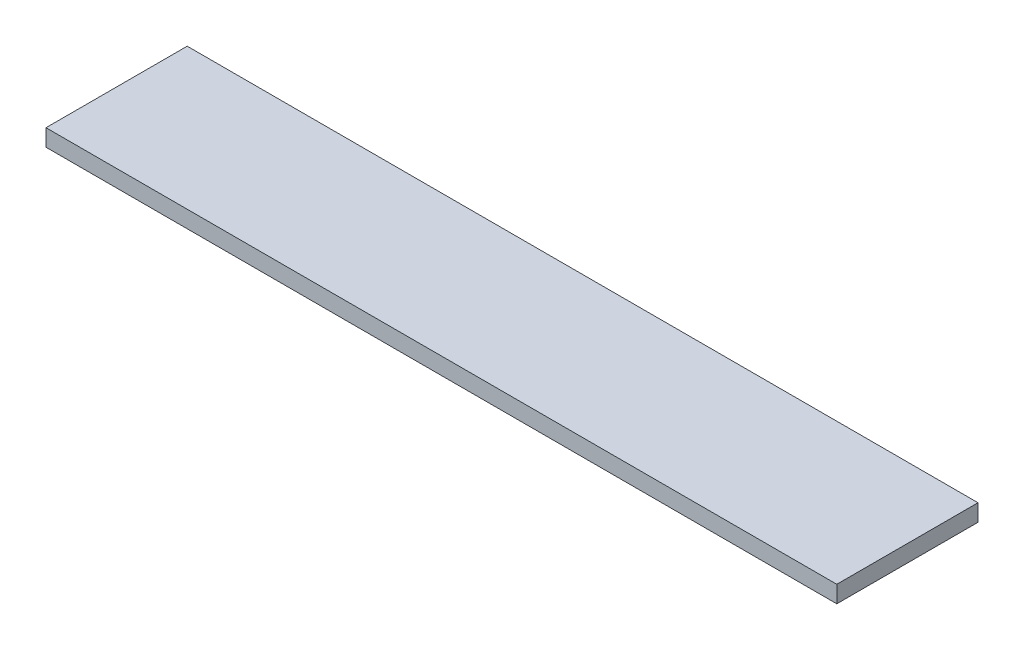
ISO-10303-21;
HEADER;
FILE_DESCRIPTION(('STEP AP214'),'2;1');
FILE_NAME('part.step','',(''),(''),'','','');
FILE_SCHEMA(('AUTOMOTIVE_DESIGN { 1 0 10303 214 1 1 1 1 }'));
ENDSEC;
DATA;
#1=APPLICATION_CONTEXT('core data for automotive mechanical design processes');
#2=APPLICATION_PROTOCOL_DEFINITION('international standard','automotive_design',2000,#1);
#3=PRODUCT_CONTEXT('',#1,'mechanical');
#4=PRODUCT('Part','Part','',(#3));
#5=PRODUCT_RELATED_PRODUCT_CATEGORY('part','',(#4));
#6=PRODUCT_DEFINITION_FORMATION('','',#4);
#7=PRODUCT_DEFINITION_CONTEXT('part definition',#1,'design');
#8=PRODUCT_DEFINITION('design','',#6,#7);
#9=PRODUCT_DEFINITION_SHAPE('','',#8);
#10=(LENGTH_UNIT() NAMED_UNIT(*) SI_UNIT(.MILLI.,.METRE.));
#11=(NAMED_UNIT(*) PLANE_ANGLE_UNIT() SI_UNIT($,.RADIAN.));
#12=(NAMED_UNIT(*) SI_UNIT($,.STERADIAN.) SOLID_ANGLE_UNIT());
#13=UNCERTAINTY_MEASURE_WITH_UNIT(LENGTH_MEASURE(1.E-05),#10,'distance_accuracy_value','');
#14=(GEOMETRIC_REPRESENTATION_CONTEXT(3) GLOBAL_UNCERTAINTY_ASSIGNED_CONTEXT((#13)) GLOBAL_UNIT_ASSIGNED_CONTEXT((#10,
#11,#12)) REPRESENTATION_CONTEXT('',''));
#15=CARTESIAN_POINT('',(0.,0.,0.));
#16=DIRECTION('',(0.,0.,1.));
#17=DIRECTION('',(1.,0.,0.));
#18=AXIS2_PLACEMENT_3D('',#15,#16,#17);
#19=CARTESIAN_POINT('',(0.,6.,0.));
#20=DIRECTION('',(1.,0.,0.));
#21=DIRECTION('',(0.,0.,-1.));
#22=AXIS2_PLACEMENT_3D('',#19,#20,#21);
#23=PLANE('',#22);
#24=DIRECTION('',(0.,0.,1.));
#25=VECTOR('',#24,1.);
#26=CARTESIAN_POINT('',(0.,0.,0.));
#27=LINE('',#26,#25);
#28=CARTESIAN_POINT('',(0.,0.,-50.));
#29=VERTEX_POINT('',#28);
#30=CARTESIAN_POINT('',(0.,0.,0.));
#31=VERTEX_POINT('',#30);
#32=EDGE_CURVE('E96',#29,#31,#27,.T.);
#33=ORIENTED_EDGE('',*,*,#32,.T.);
#34=DIRECTION('',(0.,-1.,0.));
#35=VECTOR('',#34,1.);
#36=CARTESIAN_POINT('',(0.,6.,0.));
#37=LINE('',#36,#35);
#38=CARTESIAN_POINT('',(0.,6.,0.));
#39=VERTEX_POINT('',#38);
#40=EDGE_CURVE('E11',#39,#31,#37,.T.);
#41=ORIENTED_EDGE('',*,*,#40,.F.);
#42=DIRECTION('',(0.,0.,1.));
#43=VECTOR('',#42,1.);
#44=CARTESIAN_POINT('',(0.,6.,0.));
#45=LINE('',#44,#43);
#46=CARTESIAN_POINT('',(0.,6.,-50.));
#47=VERTEX_POINT('',#46);
#48=EDGE_CURVE('E84',#47,#39,#45,.T.);
#49=ORIENTED_EDGE('',*,*,#48,.F.);
#50=DIRECTION('',(0.,-1.,0.));
#51=VECTOR('',#50,1.);
#52=CARTESIAN_POINT('',(0.,6.,-50.));
#53=LINE('',#52,#51);
#54=EDGE_CURVE('E92',#47,#29,#53,.T.);
#55=ORIENTED_EDGE('',*,*,#54,.T.);
#56=EDGE_LOOP('',(#33,#41,#49,#55));
#57=FACE_BOUND('',#56,.T.);
#58=ADVANCED_FACE('F33',(#57),#23,.F.);
#59=CARTESIAN_POINT('',(0.,6.,0.));
#60=DIRECTION('',(0.,0.,-1.));
#61=DIRECTION('',(-1.,0.,0.));
#62=AXIS2_PLACEMENT_3D('',#59,#60,#61);
#63=PLANE('',#62);
#64=DIRECTION('',(1.,0.,0.));
#65=VECTOR('',#64,1.);
#66=CARTESIAN_POINT('',(0.,0.,0.));
#67=LINE('',#66,#65);
#68=CARTESIAN_POINT('',(280.,0.,0.));
#69=VERTEX_POINT('',#68);
#70=EDGE_CURVE('E88',#31,#69,#67,.T.);
#71=ORIENTED_EDGE('',*,*,#70,.T.);
#72=DIRECTION('',(0.,-1.,0.));
#73=VECTOR('',#72,1.);
#74=CARTESIAN_POINT('',(280.,6.,0.));
#75=LINE('',#74,#73);
#76=CARTESIAN_POINT('',(280.,6.,0.));
#77=VERTEX_POINT('',#76);
#78=EDGE_CURVE('E41',#77,#69,#75,.T.);
#79=ORIENTED_EDGE('',*,*,#78,.F.);
#80=DIRECTION('',(1.,0.,0.));
#81=VECTOR('',#80,1.);
#82=CARTESIAN_POINT('',(0.,6.,0.));
#83=LINE('',#82,#81);
#84=EDGE_CURVE('E79',#39,#77,#83,.T.);
#85=ORIENTED_EDGE('',*,*,#84,.F.);
#86=ORIENTED_EDGE('',*,*,#40,.T.);
#87=EDGE_LOOP('',(#71,#79,#85,#86));
#88=FACE_BOUND('',#87,.T.);
#89=ADVANCED_FACE('F87',(#88),#63,.F.);
#90=CARTESIAN_POINT('',(280.,6.,0.));
#91=DIRECTION('',(-1.,0.,0.));
#92=DIRECTION('',(0.,0.,1.));
#93=AXIS2_PLACEMENT_3D('',#90,#91,#92);
#94=PLANE('',#93);
#95=DIRECTION('',(0.,0.,-1.));
#96=VECTOR('',#95,1.);
#97=CARTESIAN_POINT('',(280.,0.,0.));
#98=LINE('',#97,#96);
#99=CARTESIAN_POINT('',(280.,0.,-50.));
#100=VERTEX_POINT('',#99);
#101=EDGE_CURVE('E66',#69,#100,#98,.T.);
#102=ORIENTED_EDGE('',*,*,#101,.T.);
#103=DIRECTION('',(0.,-1.,0.));
#104=VECTOR('',#103,1.);
#105=CARTESIAN_POINT('',(280.,6.,-50.));
#106=LINE('',#105,#104);
#107=CARTESIAN_POINT('',(280.,6.,-50.));
#108=VERTEX_POINT('',#107);
#109=EDGE_CURVE('E89',#108,#100,#106,.T.);
#110=ORIENTED_EDGE('',*,*,#109,.F.);
#111=DIRECTION('',(0.,0.,-1.));
#112=VECTOR('',#111,1.);
#113=CARTESIAN_POINT('',(280.,6.,0.));
#114=LINE('',#113,#112);
#115=EDGE_CURVE('E82',#77,#108,#114,.T.);
#116=ORIENTED_EDGE('',*,*,#115,.F.);
#117=ORIENTED_EDGE('',*,*,#78,.T.);
#118=EDGE_LOOP('',(#102,#110,#116,#117));
#119=FACE_BOUND('',#118,.T.);
#120=ADVANCED_FACE('F90',(#119),#94,.F.);
#121=CARTESIAN_POINT('',(0.,6.,-50.));
#122=DIRECTION('',(0.,0.,1.));
#123=DIRECTION('',(1.,0.,0.));
#124=AXIS2_PLACEMENT_3D('',#121,#122,#123);
#125=PLANE('',#124);
#126=DIRECTION('',(-1.,0.,0.));
#127=VECTOR('',#126,1.);
#128=CARTESIAN_POINT('',(0.,0.,-50.));
#129=LINE('',#128,#127);
#130=EDGE_CURVE('E72',#100,#29,#129,.T.);
#131=ORIENTED_EDGE('',*,*,#130,.T.);
#132=ORIENTED_EDGE('',*,*,#54,.F.);
#133=DIRECTION('',(-1.,0.,0.));
#134=VECTOR('',#133,1.);
#135=CARTESIAN_POINT('',(0.,6.,-50.));
#136=LINE('',#135,#134);
#137=EDGE_CURVE('E49',#108,#47,#136,.T.);
#138=ORIENTED_EDGE('',*,*,#137,.F.);
#139=ORIENTED_EDGE('',*,*,#109,.T.);
#140=EDGE_LOOP('',(#131,#132,#138,#139));
#141=FACE_BOUND('',#140,.T.);
#142=ADVANCED_FACE('F103',(#141),#125,.F.);
#143=CARTESIAN_POINT('',(0.,6.,0.));
#144=DIRECTION('',(0.,-1.,0.));
#145=DIRECTION('',(0.,0.,-1.));
#146=AXIS2_PLACEMENT_3D('',#143,#144,#145);
#147=PLANE('',#146);
#148=ORIENTED_EDGE('',*,*,#48,.T.);
#149=ORIENTED_EDGE('',*,*,#84,.T.);
#150=ORIENTED_EDGE('',*,*,#115,.T.);
#151=ORIENTED_EDGE('',*,*,#137,.T.);
#152=EDGE_LOOP('',(#148,#149,#150,#151));
#153=FACE_BOUND('',#152,.T.);
#154=ADVANCED_FACE('F80',(#153),#147,.F.);
#155=CARTESIAN_POINT('',(0.,0.,0.));
#156=DIRECTION('',(0.,-1.,0.));
#157=DIRECTION('',(0.,0.,-1.));
#158=AXIS2_PLACEMENT_3D('',#155,#156,#157);
#159=PLANE('',#158);
#160=ORIENTED_EDGE('',*,*,#32,.F.);
#161=ORIENTED_EDGE('',*,*,#130,.F.);
#162=ORIENTED_EDGE('',*,*,#101,.F.);
#163=ORIENTED_EDGE('',*,*,#70,.F.);
#164=EDGE_LOOP('',(#160,#161,#162,#163));
#165=FACE_BOUND('',#164,.T.);
#166=ADVANCED_FACE('F106',(#165),#159,.T.);
#167=CLOSED_SHELL('',(#58,#89,#120,#142,#154,#166));
#168=MANIFOLD_SOLID_BREP('B2',#167);
#169=ADVANCED_BREP_SHAPE_REPRESENTATION('',(#18,#168),#14);
#170=SHAPE_DEFINITION_REPRESENTATION(#9,#169);
ENDSEC;
END-ISO-10303-21;
